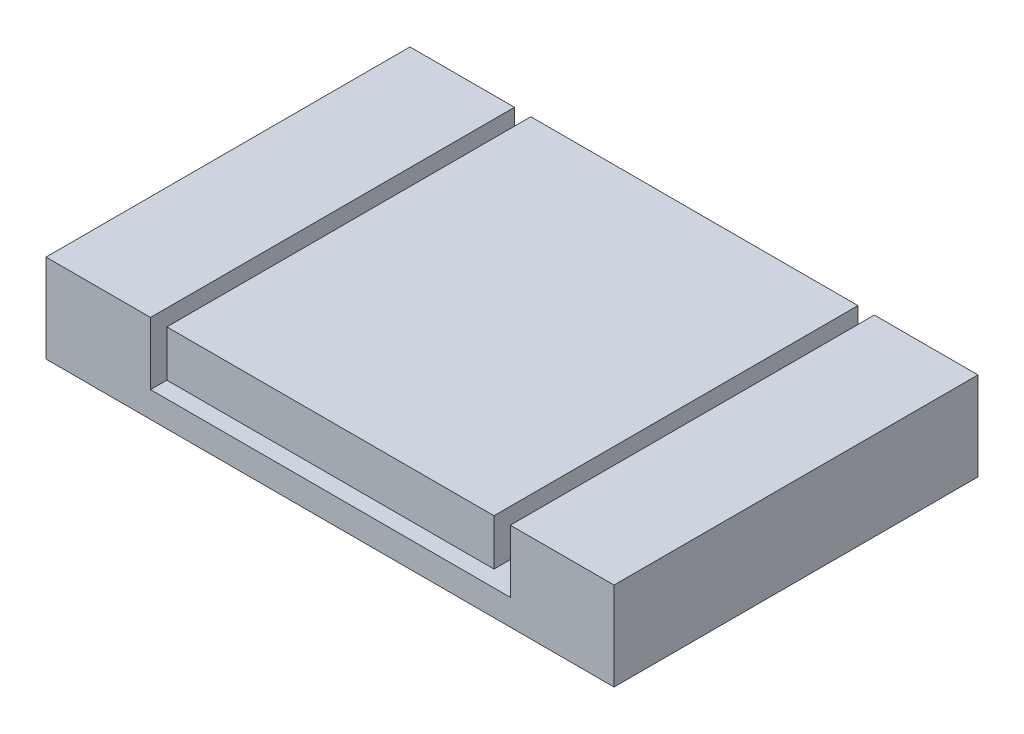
from build123d import *

# Parameters (mm, degrees)
SKETCH1_W               = 173.591221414
SKETCH1_H               = 111.229315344
EXTRUDE1_DEPTH          = 27
SKETCH2_W               = 109.961576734
SKETCH2_H               = 36.687213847
SKETCH2_W_2             = 99.961576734
SKETCH2_H_2             = 26.687213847
CUT_EXTRUDE_THIN1_DEPTH = 144.646923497


with BuildPart() as part:
    # Sketch1 → Extrude1 (new body)
    with BuildSketch(Plane(origin=(0, 0, 0), x_dir=(1, 0, 0), z_dir=(0, 1, 0))):
        Rectangle(SKETCH1_W, SKETCH1_H)
    extrude(amount=EXTRUDE1_DEPTH)

    # Sketch2 → Cut-Extrude-Thin1 (cut, through all)
    with BuildSketch(Plane.XY.offset(55.614657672)):
        with Locations((0.128485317, 26.237079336)):
            Rectangle(SKETCH2_W, SKETCH2_H)
        with Locations((0.128485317, 26.237079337)):
            Rectangle(SKETCH2_W_2, SKETCH2_H_2, mode=Mode.SUBTRACT)
    extrude(amount=-CUT_EXTRUDE_THIN1_DEPTH, mode=Mode.SUBTRACT)


with BuildPart() as cut_extrude_thin1_piece_1:
    # of the separate pieces the step leaves, piece 1, a body of its own (cut_extrude_thin1_pieces)
    add(part.part.solids().sort_by_distance((-86.795610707, 0, -55.614657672))[0])


with BuildPart() as cut_extrude_thin1_piece_2:
    # of the separate pieces the step leaves, piece 2, a body of its own (cut_extrude_thin1_pieces)
    add(part.part.solids().sort_by_distance((-49.85230305, 27, -55.614657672))[0])


solid = Compound([cut_extrude_thin1_piece_1.part, cut_extrude_thin1_piece_2.part])
